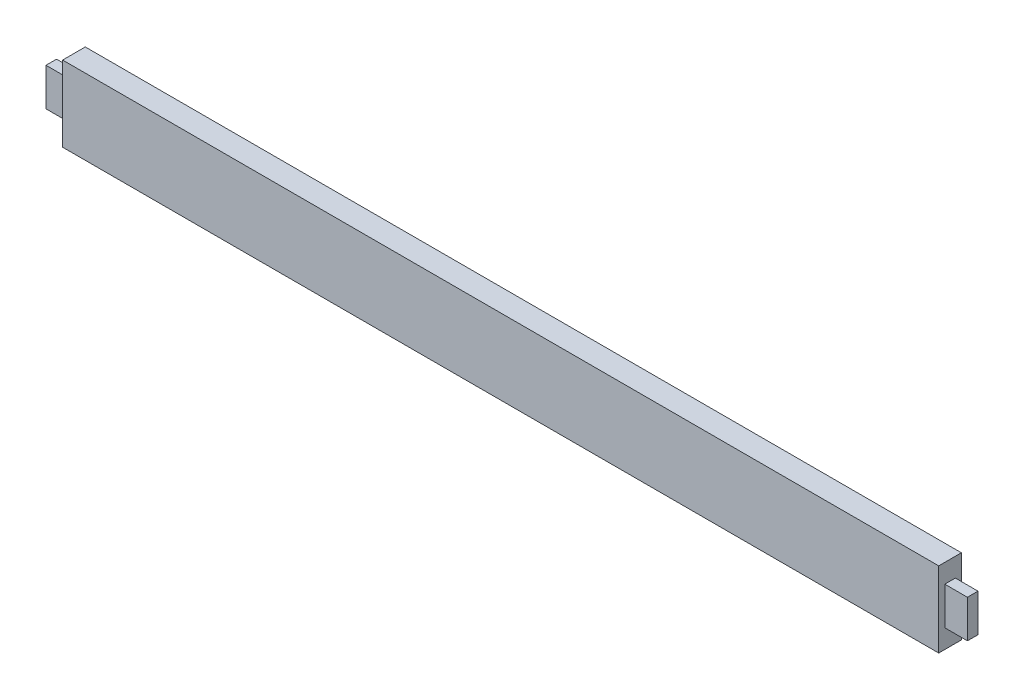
from build123d import *

# Parameters (mm, degrees)
CROQUIS1_W              = 15
CROQUIS1_H              = 50
SALIENTE_EXTRUIR1_DEPTH = 580
CROQUIS2_W              = 7
CROQUIS2_H              = 25
SALIENTE_EXTRUIR2_DEPTH = 15
SALIENTE_EXTRUIR3_START = 580
CROQUIS2_2_W            = 7
CROQUIS2_2_H            = 25
SALIENTE_EXTRUIR3_DEPTH = 15


with BuildPart() as part:
    # Croquis1 → Saliente-Extruir1 (new body)
    with BuildSketch(Plane(origin=(0, 0, 0), x_dir=(0, 0, -1), z_dir=(1, 0, 0))):
        with Locations((7.5, 25)):
            Rectangle(CROQUIS1_W, CROQUIS1_H)
    extrude(amount=SALIENTE_EXTRUIR1_DEPTH)

    # Croquis2 → Saliente-Extruir2 (add)
    with BuildSketch(Plane(origin=(0, 0, 0), x_dir=(0, 0, -1), z_dir=(1, 0, 0))):
        with Locations((7.5, 25)):
            Rectangle(CROQUIS2_W, CROQUIS2_H)
    extrude(amount=-SALIENTE_EXTRUIR2_DEPTH)

    # Croquis2_2 → Saliente-Extruir3 (add)
    with BuildSketch(Plane(origin=(0, 0, 0), x_dir=(0, 0, -1), z_dir=(1, 0, 0)).offset(SALIENTE_EXTRUIR3_START)):
        with Locations((7.5, 25)):
            Rectangle(CROQUIS2_2_W, CROQUIS2_2_H)
    extrude(amount=SALIENTE_EXTRUIR3_DEPTH)


solid = part.part
